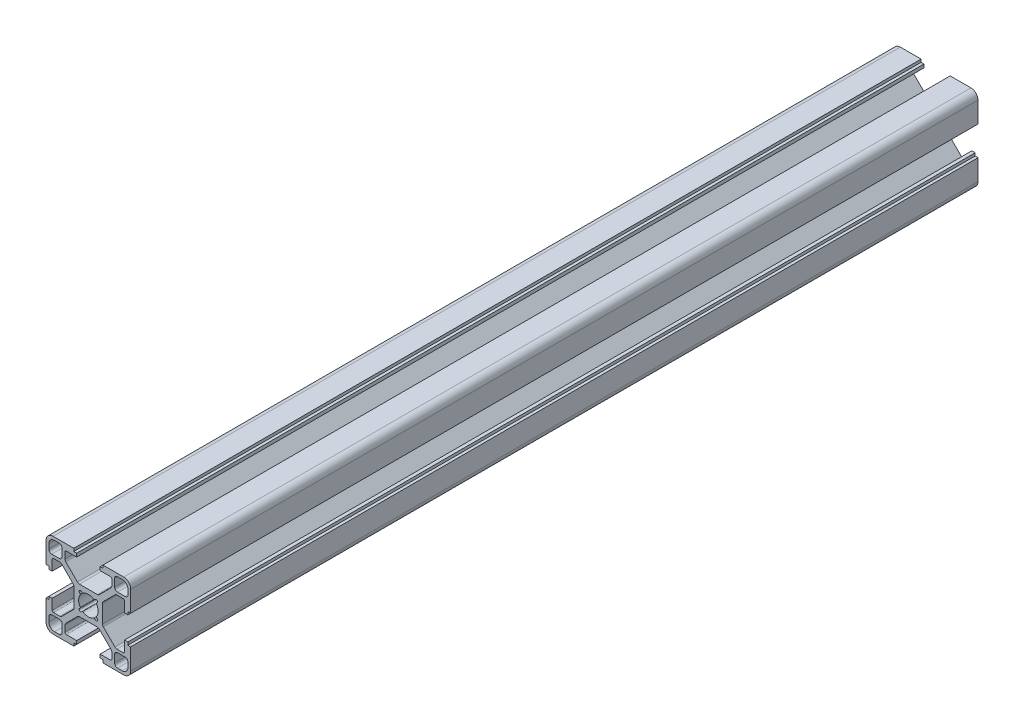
from build123d import *

# Parameters (mm, degrees)
EXTRUDE_1_DEPTH = 150


with BuildPart() as part:
    # Sketch 1 → Extrude 1 (new, symmetric)
    with BuildSketch(Plane.XY):
        with BuildLine():
            Line((12.499999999, 14.999999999), (5.150000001, 14.999999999))
            Line((5.150000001, 14.999999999), (5.150000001, 14))
            Line((5.150000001, 14), (4.149999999, 14))
            Line((4.149999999, 14), (4.149999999, 12.799999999))
            Line((4.149999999, 12.799999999), (7.8, 12.799999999))
            ThreePointArc((7.8, 12.799999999), (8.153553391, 12.65355339), (8.3, 12.299999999))
            Line((8.3, 12.299999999), (8.3, 10.128427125))
            ThreePointArc((8.3, 10.128427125), (8.223879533, 9.745743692), (8.007106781, 9.421320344))
            Line((8.007106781, 9.421320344), (3.878679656, 5.292893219))
            ThreePointArc((3.878679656, 5.292893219), (3.554256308, 5.076120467), (3.171572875, 5))
            Line((3.171572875, 5), (0, 5))
            Line((0, 5), (-3.171572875, 5))
            ThreePointArc((-3.171572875, 5), (-3.554256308, 5.076120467), (-3.878679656, 5.292893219))
            Line((-3.878679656, 5.292893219), (-8.007106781, 9.421320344))
            ThreePointArc((-8.007106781, 9.421320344), (-8.223879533, 9.745743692), (-8.3, 10.128427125))
            Line((-8.3, 10.128427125), (-8.3, 12.299999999))
            ThreePointArc((-8.3, 12.299999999), (-8.153553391, 12.65355339), (-7.8, 12.799999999))
            Line((-7.8, 12.799999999), (-4.149999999, 12.799999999))
            Line((-4.149999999, 12.799999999), (-4.149999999, 14))
            Line((-4.149999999, 14), (-5.150000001, 14))
            Line((-5.150000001, 14), (-5.150000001, 14.999999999))
            Line((-5.150000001, 14.999999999), (-12.499999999, 14.999999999))
            ThreePointArc((-12.499999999, 14.999999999), (-13.45670858, 14.80969883), (-14.267766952, 14.267766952))
            ThreePointArc((-14.267766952, 14.267766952), (-14.80969883, 13.45670858), (-14.999999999, 12.499999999))
            Line((-14.999999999, 12.499999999), (-14.999999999, 5.150000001))
            Line((-14.999999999, 5.150000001), (-14, 5.150000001))
            Line((-14, 5.150000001), (-14, 4.149999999))
            Line((-14, 4.149999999), (-12.799999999, 4.149999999))
            Line((-12.799999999, 4.149999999), (-12.799999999, 7.8))
            ThreePointArc((-12.799999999, 7.8), (-12.65355339, 8.153553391), (-12.299999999, 8.3))
            Line((-12.299999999, 8.3), (-10.128427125, 8.3))
            ThreePointArc((-10.128427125, 8.3), (-9.745743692, 8.223879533), (-9.421320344, 8.007106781))
            Line((-9.421320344, 8.007106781), (-5.292893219, 3.878679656))
            ThreePointArc((-5.292893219, 3.878679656), (-5.076120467, 3.554256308), (-5, 3.171572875))
            Line((-5, 3.171572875), (-5, 0))
            Line((-5, 0), (-5, -3.171572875))
            ThreePointArc((-5, -3.171572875), (-5.076120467, -3.554256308), (-5.292893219, -3.878679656))
            Line((-5.292893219, -3.878679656), (-9.421320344, -8.007106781))
            ThreePointArc((-9.421320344, -8.007106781), (-9.745743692, -8.223879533), (-10.128427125, -8.3))
            Line((-10.128427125, -8.3), (-12.299999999, -8.3))
            ThreePointArc((-12.299999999, -8.3), (-12.65355339, -8.153553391), (-12.799999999, -7.8))
            Line((-12.799999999, -7.8), (-12.799999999, -4.149999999))
            Line((-12.799999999, -4.149999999), (-14, -4.149999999))
            Line((-14, -4.149999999), (-14, -5.150000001))
            Line((-14, -5.150000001), (-14.999999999, -5.150000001))
            Line((-14.999999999, -5.150000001), (-14.999999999, -12.499999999))
            ThreePointArc((-14.999999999, -12.499999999), (-14.80969883, -13.45670858), (-14.267766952, -14.267766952))
            ThreePointArc((-14.267766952, -14.267766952), (-13.45670858, -14.80969883), (-12.499999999, -14.999999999))
            Line((-12.499999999, -14.999999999), (-5.150000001, -14.999999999))
            Line((-5.150000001, -14.999999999), (-5.150000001, -14))
            Line((-5.150000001, -14), (-4.149999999, -14))
            Line((-4.149999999, -14), (-4.149999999, -12.799999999))
            Line((-4.149999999, -12.799999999), (-7.8, -12.799999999))
            ThreePointArc((-7.8, -12.799999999), (-8.153553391, -12.65355339), (-8.3, -12.299999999))
            Line((-8.3, -12.299999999), (-8.3, -10.128427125))
            ThreePointArc((-8.3, -10.128427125), (-8.223879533, -9.745743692), (-8.007106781, -9.421320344))
            Line((-8.007106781, -9.421320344), (-3.878679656, -5.292893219))
            ThreePointArc((-3.878679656, -5.292893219), (-3.554256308, -5.076120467), (-3.171572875, -5))
            Line((-3.171572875, -5), (0, -5))
            Line((0, -5), (3.171572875, -5))
            ThreePointArc((3.171572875, -5), (3.554256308, -5.076120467), (3.878679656, -5.292893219))
            Line((3.878679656, -5.292893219), (8.007106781, -9.421320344))
            ThreePointArc((8.007106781, -9.421320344), (8.223879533, -9.745743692), (8.3, -10.128427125))
            Line((8.3, -10.128427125), (8.3, -12.299999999))
            ThreePointArc((8.3, -12.299999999), (8.153553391, -12.65355339), (7.8, -12.799999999))
            Line((7.8, -12.799999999), (4.149999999, -12.799999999))
            Line((4.149999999, -12.799999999), (4.149999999, -14))
            Line((4.149999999, -14), (5.150000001, -14))
            Line((5.150000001, -14), (5.150000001, -14.999999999))
            Line((5.150000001, -14.999999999), (12.499999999, -14.999999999))
            ThreePointArc((12.499999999, -14.999999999), (13.45670858, -14.80969883), (14.267766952, -14.267766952))
            ThreePointArc((14.267766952, -14.267766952), (14.80969883, -13.45670858), (14.999999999, -12.499999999))
            Line((14.999999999, -12.499999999), (14.999999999, -5.150000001))
            Line((14.999999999, -5.150000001), (14, -5.150000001))
            Line((14, -5.150000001), (14, -4.149999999))
            Line((14, -4.149999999), (12.799999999, -4.149999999))
            Line((12.799999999, -4.149999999), (12.799999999, -7.8))
            ThreePointArc((12.799999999, -7.8), (12.65355339, -8.153553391), (12.299999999, -8.3))
            Line((12.299999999, -8.3), (10.128427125, -8.3))
            ThreePointArc((10.128427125, -8.3), (9.745743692, -8.223879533), (9.421320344, -8.007106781))
            Line((9.421320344, -8.007106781), (5.292893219, -3.878679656))
            ThreePointArc((5.292893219, -3.878679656), (5.076120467, -3.554256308), (5, -3.171572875))
            Line((5, -3.171572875), (5, 0))
            Line((5, 0), (5, 3.171572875))
            ThreePointArc((5, 3.171572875), (5.076120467, 3.554256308), (5.292893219, 3.878679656))
            Line((5.292893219, 3.878679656), (9.421320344, 8.007106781))
            ThreePointArc((9.421320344, 8.007106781), (9.745743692, 8.223879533), (10.128427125, 8.3))
            Line((10.128427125, 8.3), (12.299999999, 8.3))
            ThreePointArc((12.299999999, 8.3), (12.65355339, 8.153553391), (12.799999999, 7.8))
            Line((12.799999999, 7.8), (12.799999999, 4.149999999))
            Line((12.799999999, 4.149999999), (14, 4.149999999))
            Line((14, 4.149999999), (14, 5.150000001))
            Line((14, 5.150000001), (14.999999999, 5.150000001))
            Line((14.999999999, 5.150000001), (14.999999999, 12.499999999))
            ThreePointArc((14.999999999, 12.499999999), (14.80969883, 13.45670858), (14.267766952, 14.267766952))
            ThreePointArc((14.267766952, 14.267766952), (13.45670858, 14.80969883), (12.499999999, 14.999999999))
        make_face()
        with BuildLine():
            Line((-9.3, 10.3), (-9.3, 12.999999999))
            ThreePointArc((-9.3, 12.999999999), (-9.592893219, 13.70710678), (-10.3, 13.999999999))
            Line((-10.3, 13.999999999), (-11.999999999, 13.999999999))
            ThreePointArc((-11.999999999, 13.999999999), (-13.414213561, 13.414213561), (-13.999999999, 11.999999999))
            Line((-13.999999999, 11.999999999), (-13.999999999, 10.3))
            ThreePointArc((-13.999999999, 10.3), (-13.70710678, 9.592893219), (-12.999999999, 9.3))
            Line((-12.999999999, 9.3), (-10.3, 9.3))
            ThreePointArc((-10.3, 9.3), (-9.917316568, 9.376120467), (-9.592893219, 9.592893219))
            ThreePointArc((-9.592893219, 9.592893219), (-9.376120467, 9.917316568), (-9.3, 10.3))
        make_face(mode=Mode.SUBTRACT)
        with BuildLine():
            Line((3.12007589, -2.41482806), (2.914797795, -2.209549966))
            ThreePointArc((2.914797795, -2.209549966), (2.842870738, -2.05819853), (2.882684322, -1.895423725))
            ThreePointArc((2.882684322, -1.895423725), (3.305129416, -0.989252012), (3.45, 0))
            ThreePointArc((3.45, 0), (3.305129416, 0.989252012), (2.882684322, 1.895423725))
            ThreePointArc((2.882684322, 1.895423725), (2.842870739, 2.058198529), (2.914797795, 2.209549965))
            Line((2.914797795, 2.209549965), (3.120075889, 2.414828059))
            ThreePointArc((3.120075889, 2.414828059), (3.120075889, 3.120075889), (2.41482806, 3.120075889))
            Line((2.41482806, 3.120075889), (2.209549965, 2.914797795))
            ThreePointArc((2.209549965, 2.914797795), (2.05819853, 2.842870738), (1.895423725, 2.882684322))
            ThreePointArc((1.895423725, 2.882684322), (0.989252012, 3.305129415), (0, 3.449999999))
            ThreePointArc((0, 3.449999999), (-0.989252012, 3.305129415), (-1.895423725, 2.882684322))
            ThreePointArc((-1.895423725, 2.882684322), (-2.05819853, 2.842870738), (-2.209549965, 2.914797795))
            Line((-2.209549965, 2.914797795), (-2.41482806, 3.120075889))
            ThreePointArc((-2.41482806, 3.120075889), (-3.120075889, 3.120075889), (-3.120075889, 2.41482806))
            Line((-3.120075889, 2.41482806), (-2.914797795, 2.209549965))
            ThreePointArc((-2.914797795, 2.209549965), (-2.842870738, 2.05819853), (-2.882684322, 1.895423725))
            ThreePointArc((-2.882684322, 1.895423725), (-3.305129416, 0.989252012), (-3.45, 0))
            ThreePointArc((-3.45, 0), (-3.305129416, -0.989252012), (-2.882684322, -1.895423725))
            ThreePointArc((-2.882684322, -1.895423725), (-2.842870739, -2.05819853), (-2.914797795, -2.209549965))
            Line((-2.914797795, -2.209549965), (-3.12007589, -2.41482806))
            ThreePointArc((-3.12007589, -2.41482806), (-3.12007589, -3.12007589), (-2.41482806, -3.12007589))
            Line((-2.41482806, -3.12007589), (-2.209549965, -2.914797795))
            ThreePointArc((-2.209549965, -2.914797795), (-2.05819853, -2.842870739), (-1.895423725, -2.882684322))
            ThreePointArc((-1.895423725, -2.882684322), (-0.989252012, -3.305129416), (0, -3.45))
            ThreePointArc((0, -3.45), (0.989252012, -3.305129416), (1.895423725, -2.882684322))
            ThreePointArc((1.895423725, -2.882684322), (2.05819853, -2.842870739), (2.209549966, -2.914797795))
            Line((2.209549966, -2.914797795), (2.41482806, -3.12007589))
            ThreePointArc((2.41482806, -3.12007589), (3.12007589, -3.12007589), (3.12007589, -2.41482806))
        make_face(mode=Mode.SUBTRACT)
        with BuildLine():
            Line((10.3, 9.3), (12.999999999, 9.3))
            ThreePointArc((12.999999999, 9.3), (13.70710678, 9.592893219), (13.999999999, 10.3))
            Line((13.999999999, 10.3), (13.999999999, 11.999999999))
            ThreePointArc((13.999999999, 11.999999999), (13.414213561, 13.414213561), (11.999999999, 13.999999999))
            Line((11.999999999, 13.999999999), (10.3, 13.999999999))
            ThreePointArc((10.3, 13.999999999), (9.592893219, 13.70710678), (9.3, 12.999999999))
            Line((9.3, 12.999999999), (9.3, 10.3))
            ThreePointArc((9.3, 10.3), (9.376120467, 9.917316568), (9.592893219, 9.592893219))
            ThreePointArc((9.592893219, 9.592893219), (9.917316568, 9.376120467), (10.3, 9.3))
        make_face(mode=Mode.SUBTRACT)
        with BuildLine():
            Line((-10.3, -9.3), (-12.999999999, -9.3))
            ThreePointArc((-12.999999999, -9.3), (-13.70710678, -9.592893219), (-13.999999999, -10.3))
            Line((-13.999999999, -10.3), (-13.999999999, -11.999999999))
            ThreePointArc((-13.999999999, -11.999999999), (-13.414213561, -13.414213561), (-11.999999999, -13.999999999))
            Line((-11.999999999, -13.999999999), (-10.3, -13.999999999))
            ThreePointArc((-10.3, -13.999999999), (-9.592893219, -13.70710678), (-9.3, -12.999999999))
            Line((-9.3, -12.999999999), (-9.3, -10.3))
            ThreePointArc((-9.3, -10.3), (-9.376120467, -9.917316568), (-9.592893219, -9.592893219))
            ThreePointArc((-9.592893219, -9.592893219), (-9.917316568, -9.376120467), (-10.3, -9.3))
        make_face(mode=Mode.SUBTRACT)
        with BuildLine():
            Line((9.3, -10.3), (9.3, -12.999999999))
            ThreePointArc((9.3, -12.999999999), (9.592893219, -13.70710678), (10.3, -13.999999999))
            Line((10.3, -13.999999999), (11.999999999, -13.999999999))
            ThreePointArc((11.999999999, -13.999999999), (13.414213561, -13.414213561), (13.999999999, -11.999999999))
            Line((13.999999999, -11.999999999), (13.999999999, -10.3))
            ThreePointArc((13.999999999, -10.3), (13.70710678, -9.592893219), (12.999999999, -9.3))
            Line((12.999999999, -9.3), (10.3, -9.3))
            ThreePointArc((10.3, -9.3), (9.917316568, -9.376120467), (9.592893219, -9.592893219))
            ThreePointArc((9.592893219, -9.592893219), (9.376120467, -9.917316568), (9.3, -10.3))
        make_face(mode=Mode.SUBTRACT)
    extrude(amount=EXTRUDE_1_DEPTH, both=True)


solid = part.part
